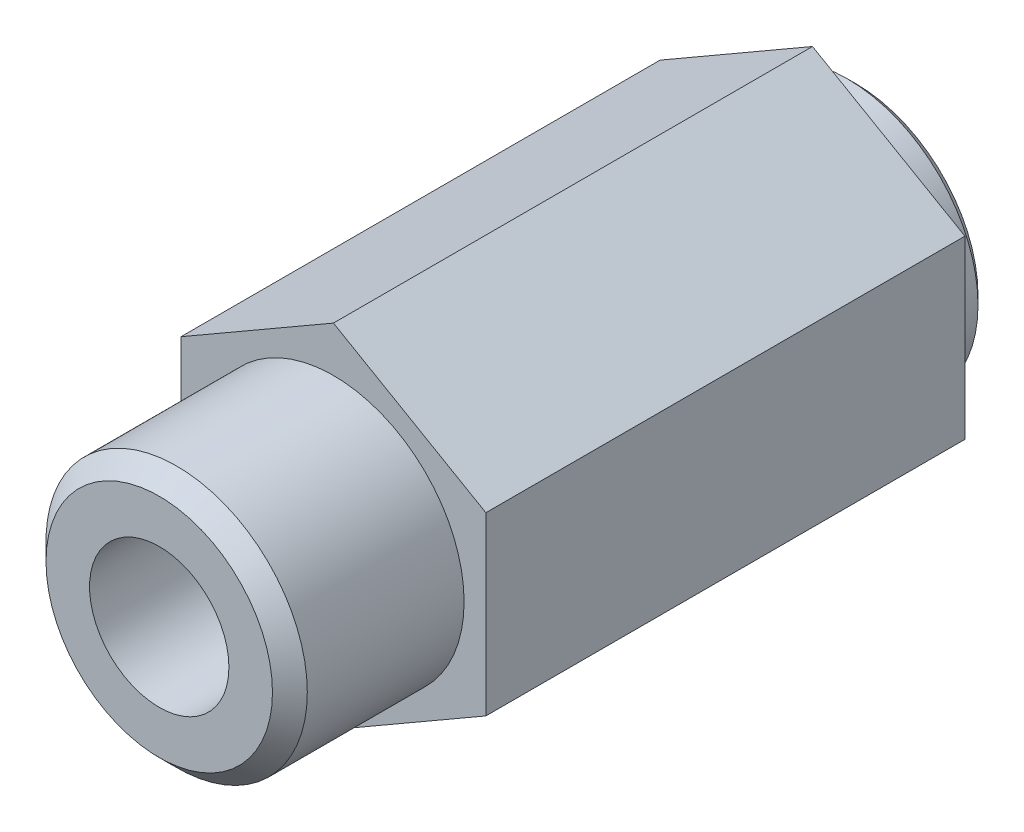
from build123d import *

# Parameters (mm, degrees)
EXTRUDE_1_DEPTH     = 55
SKETCH_2_R          = 15
EXTRUDE_3_DEPTH     = 20
EXTRUDE_START       = 5
SKETCH_3_R          = 15
EXTRUDE_4_DEPTH     = 5
SKETCH_4_R          = 10
CUT_EXTRUDE_1_DEPTH = 40
SKETCH_5_R          = 8
CUT_EXTRUDE_2_DEPTH = 40
CHAMFER_1_SIZE      = 2
CHAMFER_2_SIZE      = 1


with BuildPart() as part:
    # Sketch 1 → Extrude 1 (new body)
    with BuildSketch(Plane.XY):
        Polygon((0, 20.207259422), (-17.5, 10.103629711), (-17.5, -10.103629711), (0, -20.207259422), (17.5, -10.103629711), (17.5, 10.103629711), align=None)
    extrude(amount=EXTRUDE_1_DEPTH)

    # Sketch 2 → Extrude 3 (add)
    with BuildSketch(Plane.XY.offset(55)):
        Circle(SKETCH_2_R)
    extrude(amount=EXTRUDE_3_DEPTH)

    # Sketch 3 → Extrude 4 (add)
    with BuildSketch(Plane(origin=(0, 0, 0), x_dir=(-1, 0, 0), z_dir=(0, 0, -1)).offset(EXTRUDE_START)):
        with Locations(Location((0, 0, 0), (0, 0, 180))):
            Circle(SKETCH_3_R)
    extrude(amount=-EXTRUDE_4_DEPTH)

    # Sketch 4 → Cut-Extrude 1 (cut)
    with BuildSketch(Plane(origin=(0, 0, -5), x_dir=(-1, 0, 0), z_dir=(0, 0, -1))):
        Circle(SKETCH_4_R)
    extrude(amount=-CUT_EXTRUDE_1_DEPTH, mode=Mode.SUBTRACT)

    # Sketch 5 → Cut-Extrude 2 (cut)
    with BuildSketch(Plane.XY.offset(75)):
        Circle(SKETCH_5_R)
    extrude(amount=-CUT_EXTRUDE_2_DEPTH, mode=Mode.SUBTRACT)

    # Chamfer 1
    chamfer_1_edges = [part.edges().sort_by_distance(p)[0] for p in [
        (-15, 0, 75),
    ]]
    chamfer(chamfer_1_edges, length=CHAMFER_1_SIZE)

    # Chamfer 2
    chamfer_2_edges = [part.edges().sort_by_distance(p)[0] for p in [
        (-15, 0, -5),
    ]]
    chamfer(chamfer_2_edges, length=CHAMFER_2_SIZE)


solid = part.part
